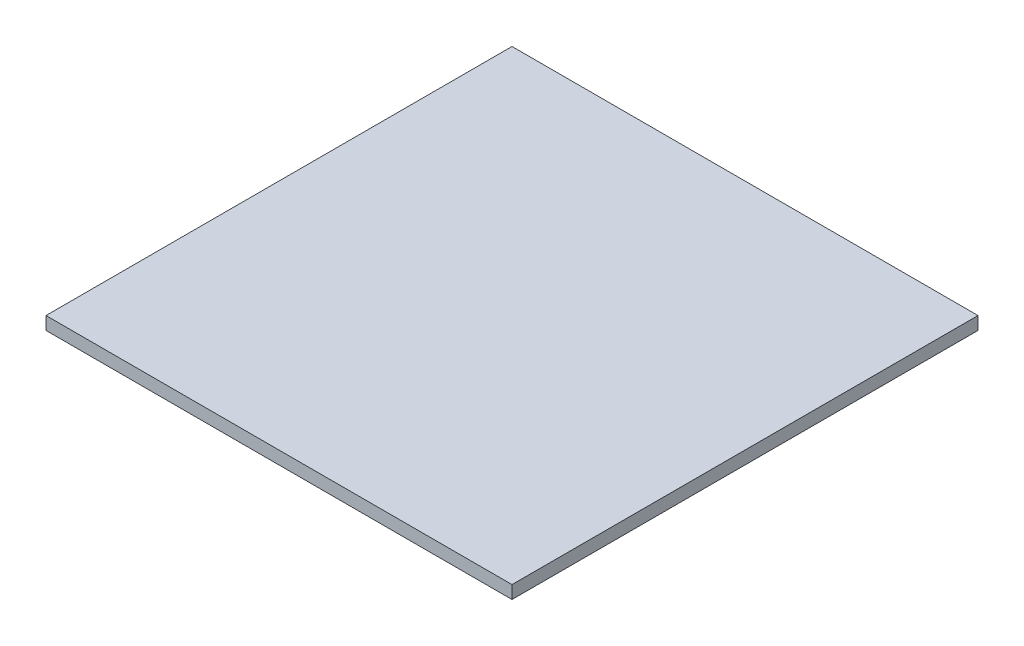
ISO-10303-21;
HEADER;
FILE_DESCRIPTION(('STEP AP214'),'2;1');
FILE_NAME('part.step','',(''),(''),'','','');
FILE_SCHEMA(('AUTOMOTIVE_DESIGN { 1 0 10303 214 1 1 1 1 }'));
ENDSEC;
DATA;
#1=APPLICATION_CONTEXT('core data for automotive mechanical design processes');
#2=APPLICATION_PROTOCOL_DEFINITION('international standard','automotive_design',2000,#1);
#3=PRODUCT_CONTEXT('',#1,'mechanical');
#4=PRODUCT('Part','Part','',(#3));
#5=PRODUCT_RELATED_PRODUCT_CATEGORY('part','',(#4));
#6=PRODUCT_DEFINITION_FORMATION('','',#4);
#7=PRODUCT_DEFINITION_CONTEXT('part definition',#1,'design');
#8=PRODUCT_DEFINITION('design','',#6,#7);
#9=PRODUCT_DEFINITION_SHAPE('','',#8);
#10=(LENGTH_UNIT() NAMED_UNIT(*) SI_UNIT(.MILLI.,.METRE.));
#11=(NAMED_UNIT(*) PLANE_ANGLE_UNIT() SI_UNIT($,.RADIAN.));
#12=(NAMED_UNIT(*) SI_UNIT($,.STERADIAN.) SOLID_ANGLE_UNIT());
#13=UNCERTAINTY_MEASURE_WITH_UNIT(LENGTH_MEASURE(1.E-05),#10,'distance_accuracy_value','');
#14=(GEOMETRIC_REPRESENTATION_CONTEXT(3) GLOBAL_UNCERTAINTY_ASSIGNED_CONTEXT((#13)) GLOBAL_UNIT_ASSIGNED_CONTEXT((#10,
#11,#12)) REPRESENTATION_CONTEXT('',''));
#15=CARTESIAN_POINT('',(0.,0.,0.));
#16=DIRECTION('',(0.,0.,1.));
#17=DIRECTION('',(1.,0.,0.));
#18=AXIS2_PLACEMENT_3D('',#15,#16,#17);
#19=CARTESIAN_POINT('',(0.,12.7,0.));
#20=DIRECTION('',(1.,0.,0.));
#21=DIRECTION('',(0.,0.,-1.));
#22=AXIS2_PLACEMENT_3D('',#19,#20,#21);
#23=PLANE('',#22);
#24=DIRECTION('',(0.,0.,1.));
#25=VECTOR('',#24,1.);
#26=CARTESIAN_POINT('',(0.,0.,0.));
#27=LINE('',#26,#25);
#28=CARTESIAN_POINT('',(0.,0.,-457.2));
#29=VERTEX_POINT('',#28);
#30=CARTESIAN_POINT('',(0.,0.,0.));
#31=VERTEX_POINT('',#30);
#32=EDGE_CURVE('E95',#29,#31,#27,.T.);
#33=ORIENTED_EDGE('',*,*,#32,.T.);
#34=DIRECTION('',(0.,-1.,0.));
#35=VECTOR('',#34,1.);
#36=CARTESIAN_POINT('',(0.,12.7,0.));
#37=LINE('',#36,#35);
#38=CARTESIAN_POINT('',(0.,12.7,0.));
#39=VERTEX_POINT('',#38);
#40=EDGE_CURVE('E11',#39,#31,#37,.T.);
#41=ORIENTED_EDGE('',*,*,#40,.F.);
#42=DIRECTION('',(0.,0.,1.));
#43=VECTOR('',#42,1.);
#44=CARTESIAN_POINT('',(0.,12.7,0.));
#45=LINE('',#44,#43);
#46=CARTESIAN_POINT('',(0.,12.7,-457.2));
#47=VERTEX_POINT('',#46);
#48=EDGE_CURVE('E83',#47,#39,#45,.T.);
#49=ORIENTED_EDGE('',*,*,#48,.F.);
#50=DIRECTION('',(0.,-1.,0.));
#51=VECTOR('',#50,1.);
#52=CARTESIAN_POINT('',(0.,12.7,-457.2));
#53=LINE('',#52,#51);
#54=EDGE_CURVE('E91',#47,#29,#53,.T.);
#55=ORIENTED_EDGE('',*,*,#54,.T.);
#56=EDGE_LOOP('',(#33,#41,#49,#55));
#57=FACE_BOUND('',#56,.T.);
#58=ADVANCED_FACE('F32',(#57),#23,.F.);
#59=CARTESIAN_POINT('',(0.,12.7,0.));
#60=DIRECTION('',(0.,0.,-1.));
#61=DIRECTION('',(-1.,0.,0.));
#62=AXIS2_PLACEMENT_3D('',#59,#60,#61);
#63=PLANE('',#62);
#64=DIRECTION('',(1.,0.,0.));
#65=VECTOR('',#64,1.);
#66=CARTESIAN_POINT('',(0.,0.,0.));
#67=LINE('',#66,#65);
#68=CARTESIAN_POINT('',(457.2,0.,0.));
#69=VERTEX_POINT('',#68);
#70=EDGE_CURVE('E87',#31,#69,#67,.T.);
#71=ORIENTED_EDGE('',*,*,#70,.T.);
#72=DIRECTION('',(0.,-1.,0.));
#73=VECTOR('',#72,1.);
#74=CARTESIAN_POINT('',(457.2,12.7,0.));
#75=LINE('',#74,#73);
#76=CARTESIAN_POINT('',(457.2,12.7,0.));
#77=VERTEX_POINT('',#76);
#78=EDGE_CURVE('E40',#77,#69,#75,.T.);
#79=ORIENTED_EDGE('',*,*,#78,.F.);
#80=DIRECTION('',(1.,0.,0.));
#81=VECTOR('',#80,1.);
#82=CARTESIAN_POINT('',(0.,12.7,0.));
#83=LINE('',#82,#81);
#84=EDGE_CURVE('E78',#39,#77,#83,.T.);
#85=ORIENTED_EDGE('',*,*,#84,.F.);
#86=ORIENTED_EDGE('',*,*,#40,.T.);
#87=EDGE_LOOP('',(#71,#79,#85,#86));
#88=FACE_BOUND('',#87,.T.);
#89=ADVANCED_FACE('F86',(#88),#63,.F.);
#90=CARTESIAN_POINT('',(457.2,12.7,0.));
#91=DIRECTION('',(-1.,0.,0.));
#92=DIRECTION('',(0.,0.,1.));
#93=AXIS2_PLACEMENT_3D('',#90,#91,#92);
#94=PLANE('',#93);
#95=DIRECTION('',(0.,0.,-1.));
#96=VECTOR('',#95,1.);
#97=CARTESIAN_POINT('',(457.2,0.,0.));
#98=LINE('',#97,#96);
#99=CARTESIAN_POINT('',(457.2,0.,-457.2));
#100=VERTEX_POINT('',#99);
#101=EDGE_CURVE('E65',#69,#100,#98,.T.);
#102=ORIENTED_EDGE('',*,*,#101,.T.);
#103=DIRECTION('',(0.,-1.,0.));
#104=VECTOR('',#103,1.);
#105=CARTESIAN_POINT('',(457.2,12.7,-457.2));
#106=LINE('',#105,#104);
#107=CARTESIAN_POINT('',(457.2,12.7,-457.2));
#108=VERTEX_POINT('',#107);
#109=EDGE_CURVE('E88',#108,#100,#106,.T.);
#110=ORIENTED_EDGE('',*,*,#109,.F.);
#111=DIRECTION('',(0.,0.,-1.));
#112=VECTOR('',#111,1.);
#113=CARTESIAN_POINT('',(457.2,12.7,0.));
#114=LINE('',#113,#112);
#115=EDGE_CURVE('E81',#77,#108,#114,.T.);
#116=ORIENTED_EDGE('',*,*,#115,.F.);
#117=ORIENTED_EDGE('',*,*,#78,.T.);
#118=EDGE_LOOP('',(#102,#110,#116,#117));
#119=FACE_BOUND('',#118,.T.);
#120=ADVANCED_FACE('F89',(#119),#94,.F.);
#121=CARTESIAN_POINT('',(0.,12.7,-457.2));
#122=DIRECTION('',(0.,0.,1.));
#123=DIRECTION('',(1.,0.,0.));
#124=AXIS2_PLACEMENT_3D('',#121,#122,#123);
#125=PLANE('',#124);
#126=DIRECTION('',(-1.,0.,0.));
#127=VECTOR('',#126,1.);
#128=CARTESIAN_POINT('',(0.,0.,-457.2));
#129=LINE('',#128,#127);
#130=EDGE_CURVE('E71',#100,#29,#129,.T.);
#131=ORIENTED_EDGE('',*,*,#130,.T.);
#132=ORIENTED_EDGE('',*,*,#54,.F.);
#133=DIRECTION('',(-1.,0.,0.));
#134=VECTOR('',#133,1.);
#135=CARTESIAN_POINT('',(0.,12.7,-457.2));
#136=LINE('',#135,#134);
#137=EDGE_CURVE('E48',#108,#47,#136,.T.);
#138=ORIENTED_EDGE('',*,*,#137,.F.);
#139=ORIENTED_EDGE('',*,*,#109,.T.);
#140=EDGE_LOOP('',(#131,#132,#138,#139));
#141=FACE_BOUND('',#140,.T.);
#142=ADVANCED_FACE('F102',(#141),#125,.F.);
#143=CARTESIAN_POINT('',(0.,12.7,0.));
#144=DIRECTION('',(0.,-1.,0.));
#145=DIRECTION('',(0.,0.,-1.));
#146=AXIS2_PLACEMENT_3D('',#143,#144,#145);
#147=PLANE('',#146);
#148=ORIENTED_EDGE('',*,*,#48,.T.);
#149=ORIENTED_EDGE('',*,*,#84,.T.);
#150=ORIENTED_EDGE('',*,*,#115,.T.);
#151=ORIENTED_EDGE('',*,*,#137,.T.);
#152=EDGE_LOOP('',(#148,#149,#150,#151));
#153=FACE_BOUND('',#152,.T.);
#154=ADVANCED_FACE('F79',(#153),#147,.F.);
#155=CARTESIAN_POINT('',(0.,0.,0.));
#156=DIRECTION('',(0.,-1.,0.));
#157=DIRECTION('',(0.,0.,-1.));
#158=AXIS2_PLACEMENT_3D('',#155,#156,#157);
#159=PLANE('',#158);
#160=ORIENTED_EDGE('',*,*,#32,.F.);
#161=ORIENTED_EDGE('',*,*,#130,.F.);
#162=ORIENTED_EDGE('',*,*,#101,.F.);
#163=ORIENTED_EDGE('',*,*,#70,.F.);
#164=EDGE_LOOP('',(#160,#161,#162,#163));
#165=FACE_BOUND('',#164,.T.);
#166=ADVANCED_FACE('F105',(#165),#159,.T.);
#167=CLOSED_SHELL('',(#58,#89,#120,#142,#154,#166));
#168=MANIFOLD_SOLID_BREP('B2',#167);
#169=ADVANCED_BREP_SHAPE_REPRESENTATION('',(#18,#168),#14);
#170=SHAPE_DEFINITION_REPRESENTATION(#9,#169);
ENDSEC;
END-ISO-10303-21;
